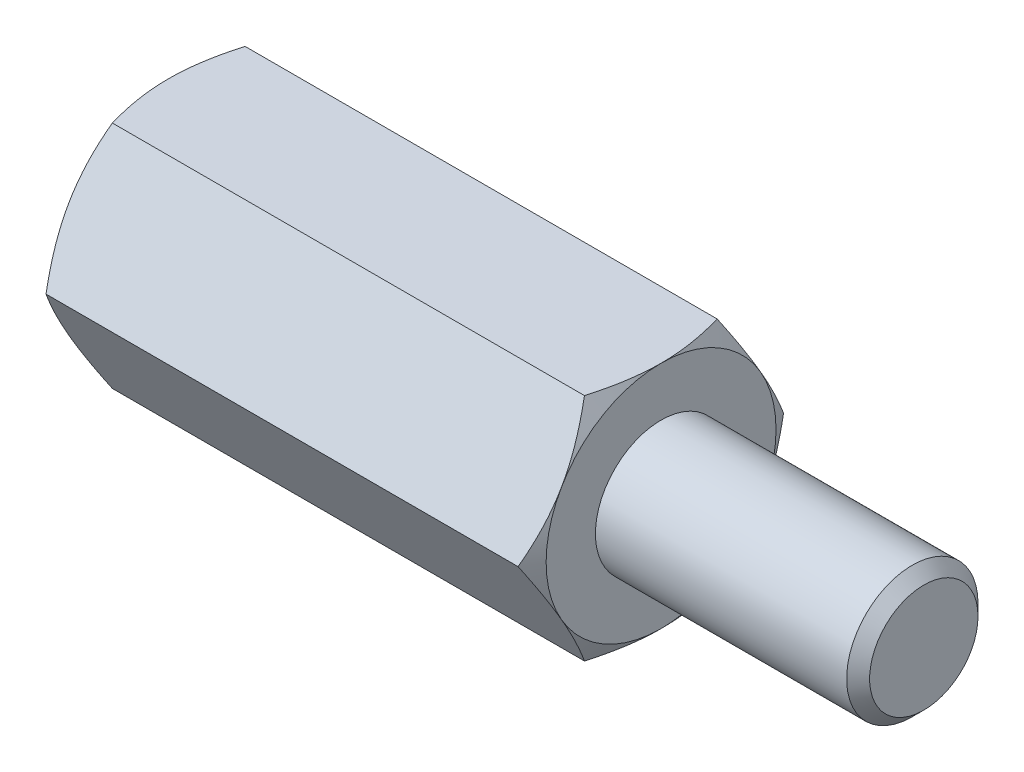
ISO-10303-21;
HEADER;
FILE_DESCRIPTION(('STEP AP214'),'2;1');
FILE_NAME('part.step','',(''),(''),'','','');
FILE_SCHEMA(('AUTOMOTIVE_DESIGN { 1 0 10303 214 1 1 1 1 }'));
ENDSEC;
DATA;
#1=APPLICATION_CONTEXT('core data for automotive mechanical design processes');
#2=APPLICATION_PROTOCOL_DEFINITION('international standard','automotive_design',2000,#1);
#3=PRODUCT_CONTEXT('',#1,'mechanical');
#4=PRODUCT('Part','Part','',(#3));
#5=PRODUCT_RELATED_PRODUCT_CATEGORY('part','',(#4));
#6=PRODUCT_DEFINITION_FORMATION('','',#4);
#7=PRODUCT_DEFINITION_CONTEXT('part definition',#1,'design');
#8=PRODUCT_DEFINITION('design','',#6,#7);
#9=PRODUCT_DEFINITION_SHAPE('','',#8);
#10=(LENGTH_UNIT() NAMED_UNIT(*) SI_UNIT(.MILLI.,.METRE.));
#11=(NAMED_UNIT(*) PLANE_ANGLE_UNIT() SI_UNIT($,.RADIAN.));
#12=(NAMED_UNIT(*) SI_UNIT($,.STERADIAN.) SOLID_ANGLE_UNIT());
#13=UNCERTAINTY_MEASURE_WITH_UNIT(LENGTH_MEASURE(1.E-05),#10,'distance_accuracy_value','');
#14=(GEOMETRIC_REPRESENTATION_CONTEXT(3) GLOBAL_UNCERTAINTY_ASSIGNED_CONTEXT((#13)) GLOBAL_UNIT_ASSIGNED_CONTEXT((#10,
#11,#12)) REPRESENTATION_CONTEXT('',''));
#15=CARTESIAN_POINT('',(0.,0.,0.));
#16=DIRECTION('',(0.,0.,1.));
#17=DIRECTION('',(1.,0.,0.));
#18=AXIS2_PLACEMENT_3D('',#15,#16,#17);
#19=CARTESIAN_POINT('',(7.5,3.5,-2.02072594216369));
#20=DIRECTION('',(1.,0.,0.));
#21=DIRECTION('',(0.,0.,-1.));
#22=AXIS2_PLACEMENT_3D('',#19,#20,#21);
#23=PLANE('',#22);
#24=CARTESIAN_POINT('',(7.5,0.,0.));
#25=DIRECTION('',(1.,0.,0.));
#26=DIRECTION('',(0.,0.,-1.));
#27=AXIS2_PLACEMENT_3D('',#24,#25,#26);
#28=CIRCLE('',#27,3.5);
#29=CARTESIAN_POINT('',(7.5,-1.75,-3.03108891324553));
#30=VERTEX_POINT('',#29);
#31=CARTESIAN_POINT('',(7.5,1.75,-3.03108891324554));
#32=VERTEX_POINT('',#31);
#33=EDGE_CURVE('E288',#30,#32,#28,.T.);
#34=ORIENTED_EDGE('',*,*,#33,.T.);
#35=CARTESIAN_POINT('',(7.5,3.5,0.));
#36=VERTEX_POINT('',#35);
#37=EDGE_CURVE('E53',#32,#36,#28,.T.);
#38=ORIENTED_EDGE('',*,*,#37,.T.);
#39=CARTESIAN_POINT('',(7.5,1.75,3.03108891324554));
#40=VERTEX_POINT('',#39);
#41=EDGE_CURVE('E296',#36,#40,#28,.T.);
#42=ORIENTED_EDGE('',*,*,#41,.T.);
#43=CARTESIAN_POINT('',(7.5,-1.75,3.03108891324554));
#44=VERTEX_POINT('',#43);
#45=EDGE_CURVE('E301',#40,#44,#28,.T.);
#46=ORIENTED_EDGE('',*,*,#45,.T.);
#47=CARTESIAN_POINT('',(7.5,0.,0.));
#48=DIRECTION('',(-1.,0.,0.));
#49=DIRECTION('',(0.,-1.,0.));
#50=AXIS2_PLACEMENT_3D('',#47,#48,#49);
#51=CIRCLE('',#50,3.5);
#52=CARTESIAN_POINT('',(7.5,-3.5,0.));
#53=VERTEX_POINT('',#52);
#54=EDGE_CURVE('E193',#53,#44,#51,.T.);
#55=ORIENTED_EDGE('',*,*,#54,.F.);
#56=EDGE_CURVE('E61',#53,#30,#28,.T.);
#57=ORIENTED_EDGE('',*,*,#56,.T.);
#58=EDGE_LOOP('',(#34,#38,#42,#46,#55,#57));
#59=FACE_BOUND('',#58,.T.);
#60=CARTESIAN_POINT('',(7.5,0.,0.));
#61=DIRECTION('',(1.,0.,0.));
#62=DIRECTION('',(0.,0.,-1.));
#63=AXIS2_PLACEMENT_3D('',#60,#61,#62);
#64=CIRCLE('',#63,2.);
#65=CARTESIAN_POINT('',(7.5,0.,-2.));
#66=VERTEX_POINT('',#65);
#67=EDGE_CURVE('E311',#66,#66,#64,.T.);
#68=ORIENTED_EDGE('',*,*,#67,.F.);
#69=EDGE_LOOP('',(#68));
#70=FACE_BOUND('',#69,.T.);
#71=ADVANCED_FACE('F37',(#59,#70),#23,.T.);
#72=CARTESIAN_POINT('',(7.5,0.,-4.04145188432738));
#73=DIRECTION('',(0.,-0.5,0.866025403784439));
#74=DIRECTION('',(0.,-0.866025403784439,-0.5));
#75=AXIS2_PLACEMENT_3D('',#72,#73,#74);
#76=PLANE('',#75);
#77=CARTESIAN_POINT('',(7.18732593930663,-0.000200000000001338,-4.04156735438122));
#78=CARTESIAN_POINT('',(7.23861421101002,0.153607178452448,-3.9527667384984));
#79=CARTESIAN_POINT('',(7.28525904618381,0.308742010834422,-3.86319960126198));
#80=CARTESIAN_POINT('',(7.36667812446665,0.621698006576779,-3.68251437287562));
#81=CARTESIAN_POINT('',(7.40142356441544,0.779524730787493,-3.59139307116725));
#82=CARTESIAN_POINT('',(7.45550997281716,1.09322221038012,-3.41027974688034));
#83=CARTESIAN_POINT('',(7.47521091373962,1.24904469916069,-3.32031559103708));
#84=CARTESIAN_POINT('',(7.49872986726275,1.56142288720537,-3.13996396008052));
#85=CARTESIAN_POINT('',(7.50256735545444,1.71797745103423,-3.04957714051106));
#86=CARTESIAN_POINT('',(7.49458469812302,2.01050921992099,-2.88068384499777));
#87=CARTESIAN_POINT('',(7.48472456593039,2.1465302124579,-2.80215208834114));
#88=CARTESIAN_POINT('',(7.4534735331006,2.41768602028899,-2.64560020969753));
#89=CARTESIAN_POINT('',(7.4320719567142,2.55281989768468,-2.56758062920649));
#90=CARTESIAN_POINT('',(7.37856959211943,2.82453479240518,-2.41070596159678));
#91=CARTESIAN_POINT('',(7.34624200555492,2.96108141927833,-2.33187072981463));
#92=CARTESIAN_POINT('',(7.27287106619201,3.2321380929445,-2.17537608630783));
#93=CARTESIAN_POINT('',(7.23184495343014,3.36665161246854,-2.09771466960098));
#94=CARTESIAN_POINT('',(7.18732593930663,3.5002,-2.02061047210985));
#95=B_SPLINE_CURVE_WITH_KNOTS('',3,(#77,#78,#79,#80,#81,#82,#83,#84,#85,#86,#87,#88,#89,#90,#91,
#92,#93,#94),.UNSPECIFIED.,.F.,.F.,(4,2,2,2,2,2,2,2,4),(0.,0.554793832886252,1.11092123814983,
1.65328467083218,2.19498204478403,2.6666513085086,3.13875761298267,3.6213361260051,
4.10296698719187),.UNSPECIFIED.);
#96=CARTESIAN_POINT('',(7.18739260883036,0.,-4.04145188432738));
#97=VERTEX_POINT('',#96);
#98=EDGE_CURVE('E352',#97,#32,#95,.T.);
#99=ORIENTED_EDGE('',*,*,#98,.F.);
#100=DIRECTION('',(-1.,0.,0.));
#101=VECTOR('',#100,1.);
#102=CARTESIAN_POINT('',(7.5,0.,-4.04145188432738));
#103=LINE('',#102,#101);
#104=CARTESIAN_POINT('',(-7.18739260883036,0.,-4.04145188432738));
#105=VERTEX_POINT('',#104);
#106=EDGE_CURVE('E264',#97,#105,#103,.T.);
#107=ORIENTED_EDGE('',*,*,#106,.T.);
#108=CARTESIAN_POINT('',(-7.18732593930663,3.5002,-2.02061047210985));
#109=CARTESIAN_POINT('',(-7.23861421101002,3.34639282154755,-2.10941108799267));
#110=CARTESIAN_POINT('',(-7.2852590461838,3.19125798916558,-2.19897822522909));
#111=CARTESIAN_POINT('',(-7.36667812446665,2.87830199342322,-2.37966345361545));
#112=CARTESIAN_POINT('',(-7.40142356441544,2.7204752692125,-2.47078475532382));
#113=CARTESIAN_POINT('',(-7.45550997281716,2.40677778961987,-2.65189807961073));
#114=CARTESIAN_POINT('',(-7.47521091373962,2.25095530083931,-2.74186223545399));
#115=CARTESIAN_POINT('',(-7.49872986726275,1.93857711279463,-2.92221386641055));
#116=CARTESIAN_POINT('',(-7.50256735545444,1.78202254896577,-3.01260068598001));
#117=CARTESIAN_POINT('',(-7.49458469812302,1.48949078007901,-3.1814939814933));
#118=CARTESIAN_POINT('',(-7.48472456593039,1.3534697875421,-3.26002573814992));
#119=CARTESIAN_POINT('',(-7.4534735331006,1.08231397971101,-3.41657761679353));
#120=CARTESIAN_POINT('',(-7.4320719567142,0.947180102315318,-3.49459719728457));
#121=CARTESIAN_POINT('',(-7.37856959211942,0.675465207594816,-3.65147186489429));
#122=CARTESIAN_POINT('',(-7.34624200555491,0.538918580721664,-3.73030709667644));
#123=CARTESIAN_POINT('',(-7.27287106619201,0.267861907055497,-3.88680174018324));
#124=CARTESIAN_POINT('',(-7.23184495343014,0.133348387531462,-3.96446315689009));
#125=CARTESIAN_POINT('',(-7.18732593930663,-0.000200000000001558,-4.04156735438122));
#126=B_SPLINE_CURVE_WITH_KNOTS('',3,(#108,#109,#110,#111,#112,#113,#114,#115,#116,#117,#118,
#119,#120,#121,#122,#123,#124,#125),.UNSPECIFIED.,.F.,.F.,(4,2,2,2,2,2,2,2,4),(0.,
0.554793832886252,1.11092123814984,1.65328467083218,2.19498204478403,2.6666513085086,
3.13875761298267,3.6213361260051,4.10296698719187),.UNSPECIFIED.);
#127=CARTESIAN_POINT('',(-7.5,1.75,-3.03108891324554));
#128=VERTEX_POINT('',#127);
#129=EDGE_CURVE('E342',#128,#105,#126,.T.);
#130=ORIENTED_EDGE('',*,*,#129,.F.);
#131=CARTESIAN_POINT('',(-7.18739260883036,3.5,-2.02072594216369));
#132=VERTEX_POINT('',#131);
#133=EDGE_CURVE('E394',#132,#128,#126,.T.);
#134=ORIENTED_EDGE('',*,*,#133,.F.);
#135=DIRECTION('',(-1.,0.,0.));
#136=VECTOR('',#135,1.);
#137=CARTESIAN_POINT('',(7.5,3.5,-2.02072594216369));
#138=LINE('',#137,#136);
#139=CARTESIAN_POINT('',(7.18739260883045,3.5,-2.02072594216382));
#140=VERTEX_POINT('',#139);
#141=EDGE_CURVE('E279',#140,#132,#138,.T.);
#142=ORIENTED_EDGE('',*,*,#141,.F.);
#143=EDGE_CURVE('E229',#32,#140,#95,.T.);
#144=ORIENTED_EDGE('',*,*,#143,.F.);
#145=EDGE_LOOP('',(#99,#107,#130,#134,#142,#144));
#146=FACE_BOUND('',#145,.T.);
#147=ADVANCED_FACE('F148',(#146),#76,.F.);
#148=CARTESIAN_POINT('',(7.5,3.5,-2.02072594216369));
#149=DIRECTION('',(0.,-1.,0.));
#150=DIRECTION('',(0.,0.,-1.));
#151=AXIS2_PLACEMENT_3D('',#148,#149,#150);
#152=PLANE('',#151);
#153=CARTESIAN_POINT('',(5.74432944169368,3.5,-5.52571367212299));
#154=CARTESIAN_POINT('',(5.8192813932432,3.5,-5.37200190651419));
#155=CARTESIAN_POINT('',(5.89354243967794,3.5,-5.21794762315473));
#156=CARTESIAN_POINT('',(6.04029601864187,3.5,-4.90897223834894));
#157=CARTESIAN_POINT('',(6.11278829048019,3.5,-4.75405101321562));
#158=CARTESIAN_POINT('',(6.25596172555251,3.5,-4.44240758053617));
#159=CARTESIAN_POINT('',(6.32663168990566,3.5,-4.28568021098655));
#160=CARTESIAN_POINT('',(6.46520746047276,3.5,-3.97101270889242));
#161=CARTESIAN_POINT('',(6.53311339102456,3.5,-3.81307263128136));
#162=CARTESIAN_POINT('',(6.66771439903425,3.5,-3.49026114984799));
#163=CARTESIAN_POINT('',(6.73428710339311,3.5,-3.32533845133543));
#164=CARTESIAN_POINT('',(6.86262677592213,3.5,-2.99359992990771));
#165=CARTESIAN_POINT('',(6.92439321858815,3.5,-2.82678390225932));
#166=CARTESIAN_POINT('',(7.04157006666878,3.5,-2.49127529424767));
#167=CARTESIAN_POINT('',(7.09699254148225,3.5,-2.32258697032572));
#168=CARTESIAN_POINT('',(7.19976794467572,3.5,-1.98279215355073));
#169=CARTESIAN_POINT('',(7.24712331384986,3.5,-1.81168640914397));
#170=CARTESIAN_POINT('',(7.33129873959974,3.5,-1.46793354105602));
#171=CARTESIAN_POINT('',(7.36817965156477,3.5,-1.2953015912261));
#172=CARTESIAN_POINT('',(7.42939557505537,3.5,-0.94779164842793));
#173=CARTESIAN_POINT('',(7.45373192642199,3.5,-0.772913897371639));
#174=CARTESIAN_POINT('',(7.4876038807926,3.5,-0.424108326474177));
#175=CARTESIAN_POINT('',(7.49733725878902,3.5,-0.25020019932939));
#176=CARTESIAN_POINT('',(7.50170533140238,3.5,0.097823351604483));
#177=CARTESIAN_POINT('',(7.49633996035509,3.5,0.271938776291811));
#178=CARTESIAN_POINT('',(7.47501181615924,3.5,0.564711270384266));
#179=CARTESIAN_POINT('',(7.46289198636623,3.5,0.683667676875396));
#180=CARTESIAN_POINT('',(7.43230809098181,3.5,0.920767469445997));
#181=CARTESIAN_POINT('',(7.41384324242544,3.5,1.03891075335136));
#182=CARTESIAN_POINT('',(7.34989562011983,3.5,1.39193174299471));
#183=CARTESIAN_POINT('',(7.29586958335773,3.5,1.62528232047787));
#184=CARTESIAN_POINT('',(7.20145152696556,3.5,1.97433825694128));
#185=CARTESIAN_POINT('',(7.16729009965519,3.5,2.09183268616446));
#186=CARTESIAN_POINT('',(7.09523444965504,3.5,2.32568238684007));
#187=CARTESIAN_POINT('',(7.05734019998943,3.5,2.44203765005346));
#188=CARTESIAN_POINT('',(6.97844216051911,3.5,2.67364238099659));
#189=CARTESIAN_POINT('',(6.93743925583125,3.5,2.78889215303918));
#190=CARTESIAN_POINT('',(6.85282457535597,3.5,3.01842460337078));
#191=CARTESIAN_POINT('',(6.80921284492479,3.5,3.13270729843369));
#192=CARTESIAN_POINT('',(6.69582414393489,3.5,3.42150510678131));
#193=CARTESIAN_POINT('',(6.62456360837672,3.5,3.59543696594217));
#194=CARTESIAN_POINT('',(6.47810267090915,3.5,3.94163961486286));
#195=CARTESIAN_POINT('',(6.40290192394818,3.5,4.11391025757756));
#196=CARTESIAN_POINT('',(6.24942525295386,3.5,4.45713072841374));
#197=CARTESIAN_POINT('',(6.17114846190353,3.5,4.62808016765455));
#198=CARTESIAN_POINT('',(6.01218826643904,3.5,4.9688584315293));
#199=CARTESIAN_POINT('',(5.93150479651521,3.5,5.13868722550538));
#200=CARTESIAN_POINT('',(5.68638713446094,3.5,5.64726192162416));
#201=CARTESIAN_POINT('',(5.5190975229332,3.5,5.98463020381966));
#202=CARTESIAN_POINT('',(5.17958549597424,3.5,6.65678495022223));
#203=CARTESIAN_POINT('',(5.0073639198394,3.5,6.99157184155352));
#204=CARTESIAN_POINT('',(4.67608002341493,3.5,7.62749570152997));
#205=CARTESIAN_POINT('',(4.51732992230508,3.5,7.92879562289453));
#206=CARTESIAN_POINT('',(4.19774734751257,3.5,8.53030635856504));
#207=CARTESIAN_POINT('',(4.03691477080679,3.5,8.83051711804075));
#208=CARTESIAN_POINT('',(3.71417926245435,3.5,9.42918006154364));
#209=CARTESIAN_POINT('',(3.5522810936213,3.5,9.72763481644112));
#210=CARTESIAN_POINT('',(3.22727376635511,3.5,10.3238577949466));
#211=CARTESIAN_POINT('',(3.06416469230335,3.5,10.6216260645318));
#212=CARTESIAN_POINT('',(2.90061041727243,3.5,10.9191478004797));
#213=B_SPLINE_CURVE_WITH_KNOTS('',3,(#153,#154,#155,#156,#157,#158,#159,#160,#161,#162,#163,
#164,#165,#166,#167,#168,#169,#170,#171,#172,#173,#174,#175,#176,#177,#178,#179,#180,#181,#182,
#183,#184,#185,#186,#187,#188,#189,#190,#191,#192,#193,#194,#195,#196,#197,#198,#199,#200,#201,
#202,#203,#204,#205,#206,#207,#208,#209,#210,#211,#212),.UNSPECIFIED.,.F.,.F.,(4,2,2,2,2,2,2,2,
2,2,2,2,2,2,2,2,2,2,2,2,2,2,2,2,2,2,2,2,2,4),(0.,0.513041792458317,1.02615874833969,
1.54190801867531,2.05763406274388,2.59113284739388,3.1246898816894,3.65721433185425,
4.18957737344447,4.71878103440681,5.24792816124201,5.76984197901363,6.29175806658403,
6.65030258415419,7.0088913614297,7.72642330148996,8.09346920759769,8.46051776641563,
8.8274622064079,9.19440026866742,9.75822236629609,10.3220939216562,10.8861255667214,
11.4501725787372,12.579801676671,13.7092396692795,14.730918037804,15.7526471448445,
16.7712589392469,17.7898004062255),.UNSPECIFIED.);
#214=EDGE_CURVE('E227',#140,#36,#213,.T.);
#215=ORIENTED_EDGE('',*,*,#214,.F.);
#216=ORIENTED_EDGE('',*,*,#141,.T.);
#217=CARTESIAN_POINT('',(-5.74432944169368,3.5,-5.52571367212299));
#218=CARTESIAN_POINT('',(-5.8192813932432,3.5,-5.37200190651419));
#219=CARTESIAN_POINT('',(-5.89354243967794,3.5,-5.21794762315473));
#220=CARTESIAN_POINT('',(-6.04029601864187,3.5,-4.90897223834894));
#221=CARTESIAN_POINT('',(-6.11278829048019,3.5,-4.75405101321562));
#222=CARTESIAN_POINT('',(-6.25596172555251,3.5,-4.44240758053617));
#223=CARTESIAN_POINT('',(-6.32663168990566,3.5,-4.28568021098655));
#224=CARTESIAN_POINT('',(-6.46520746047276,3.5,-3.97101270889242));
#225=CARTESIAN_POINT('',(-6.53311339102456,3.5,-3.81307263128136));
#226=CARTESIAN_POINT('',(-6.66771439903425,3.5,-3.49026114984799));
#227=CARTESIAN_POINT('',(-6.73428710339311,3.5,-3.32533845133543));
#228=CARTESIAN_POINT('',(-6.86262677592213,3.5,-2.99359992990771));
#229=CARTESIAN_POINT('',(-6.92439321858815,3.5,-2.82678390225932));
#230=CARTESIAN_POINT('',(-7.04157006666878,3.5,-2.49127529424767));
#231=CARTESIAN_POINT('',(-7.09699254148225,3.5,-2.32258697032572));
#232=CARTESIAN_POINT('',(-7.19976794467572,3.5,-1.98279215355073));
#233=CARTESIAN_POINT('',(-7.24712331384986,3.5,-1.81168640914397));
#234=CARTESIAN_POINT('',(-7.33129873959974,3.5,-1.46793354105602));
#235=CARTESIAN_POINT('',(-7.36817965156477,3.5,-1.2953015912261));
#236=CARTESIAN_POINT('',(-7.42939557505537,3.5,-0.94779164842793));
#237=CARTESIAN_POINT('',(-7.45373192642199,3.5,-0.772913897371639));
#238=CARTESIAN_POINT('',(-7.4876038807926,3.5,-0.424108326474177));
#239=CARTESIAN_POINT('',(-7.49733725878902,3.5,-0.25020019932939));
#240=CARTESIAN_POINT('',(-7.50170533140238,3.5,0.0978233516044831));
#241=CARTESIAN_POINT('',(-7.49633996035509,3.5,0.271938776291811));
#242=CARTESIAN_POINT('',(-7.47501181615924,3.5,0.564711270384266));
#243=CARTESIAN_POINT('',(-7.46289198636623,3.5,0.683667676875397));
#244=CARTESIAN_POINT('',(-7.43230809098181,3.5,0.920767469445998));
#245=CARTESIAN_POINT('',(-7.41384324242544,3.5,1.03891075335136));
#246=CARTESIAN_POINT('',(-7.34989562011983,3.5,1.39193174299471));
#247=CARTESIAN_POINT('',(-7.29586958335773,3.5,1.62528232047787));
#248=CARTESIAN_POINT('',(-7.20145152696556,3.5,1.97433825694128));
#249=CARTESIAN_POINT('',(-7.16729009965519,3.5,2.09183268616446));
#250=CARTESIAN_POINT('',(-7.09523444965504,3.5,2.32568238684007));
#251=CARTESIAN_POINT('',(-7.05734019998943,3.5,2.44203765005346));
#252=CARTESIAN_POINT('',(-6.97844216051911,3.5,2.67364238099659));
#253=CARTESIAN_POINT('',(-6.93743925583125,3.5,2.78889215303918));
#254=CARTESIAN_POINT('',(-6.85282457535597,3.5,3.01842460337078));
#255=CARTESIAN_POINT('',(-6.80921284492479,3.5,3.13270729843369));
#256=CARTESIAN_POINT('',(-6.69582414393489,3.5,3.42150510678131));
#257=CARTESIAN_POINT('',(-6.62456360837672,3.5,3.59543696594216));
#258=CARTESIAN_POINT('',(-6.47810267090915,3.5,3.94163961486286));
#259=CARTESIAN_POINT('',(-6.40290192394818,3.5,4.11391025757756));
#260=CARTESIAN_POINT('',(-6.24942525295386,3.5,4.45713072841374));
#261=CARTESIAN_POINT('',(-6.17114846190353,3.5,4.62808016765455));
#262=CARTESIAN_POINT('',(-6.01218826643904,3.5,4.9688584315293));
#263=CARTESIAN_POINT('',(-5.93150479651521,3.5,5.13868722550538));
#264=CARTESIAN_POINT('',(-5.68638713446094,3.5,5.64726192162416));
#265=CARTESIAN_POINT('',(-5.5190975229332,3.5,5.98463020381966));
#266=CARTESIAN_POINT('',(-5.17958549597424,3.5,6.65678495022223));
#267=CARTESIAN_POINT('',(-5.0073639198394,3.5,6.99157184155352));
#268=CARTESIAN_POINT('',(-4.67608002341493,3.5,7.62749570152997));
#269=CARTESIAN_POINT('',(-4.51732992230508,3.5,7.92879562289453));
#270=CARTESIAN_POINT('',(-4.19774734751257,3.5,8.53030635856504));
#271=CARTESIAN_POINT('',(-4.03691477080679,3.5,8.83051711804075));
#272=CARTESIAN_POINT('',(-3.71417926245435,3.5,9.42918006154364));
#273=CARTESIAN_POINT('',(-3.5522810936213,3.5,9.72763481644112));
#274=CARTESIAN_POINT('',(-3.2272737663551,3.5,10.3238577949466));
#275=CARTESIAN_POINT('',(-3.06416469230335,3.5,10.6216260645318));
#276=CARTESIAN_POINT('',(-2.90061041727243,3.5,10.9191478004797));
#277=B_SPLINE_CURVE_WITH_KNOTS('',3,(#217,#218,#219,#220,#221,#222,#223,#224,#225,#226,#227,
#228,#229,#230,#231,#232,#233,#234,#235,#236,#237,#238,#239,#240,#241,#242,#243,#244,#245,#246,
#247,#248,#249,#250,#251,#252,#253,#254,#255,#256,#257,#258,#259,#260,#261,#262,#263,#264,#265,
#266,#267,#268,#269,#270,#271,#272,#273,#274,#275,#276),.UNSPECIFIED.,.F.,.F.,(4,2,2,2,2,2,2,2,
2,2,2,2,2,2,2,2,2,2,2,2,2,2,2,2,2,2,2,2,2,4),(0.,0.513041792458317,1.02615874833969,
1.54190801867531,2.05763406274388,2.59113284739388,3.1246898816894,3.65721433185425,
4.18957737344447,4.71878103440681,5.24792816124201,5.76984197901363,6.29175806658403,
6.65030258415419,7.0088913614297,7.72642330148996,8.09346920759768,8.46051776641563,
8.8274622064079,9.19440026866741,9.75822236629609,10.3220939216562,10.8861255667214,
11.4501725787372,12.579801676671,13.7092396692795,14.730918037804,15.7526471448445,
16.7712589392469,17.7898004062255),.UNSPECIFIED.);
#278=CARTESIAN_POINT('',(-7.5,3.5,0.));
#279=VERTEX_POINT('',#278);
#280=EDGE_CURVE('E241',#279,#132,#277,.F.);
#281=ORIENTED_EDGE('',*,*,#280,.F.);
#282=CARTESIAN_POINT('',(-7.18739260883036,3.5,2.02072594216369));
#283=VERTEX_POINT('',#282);
#284=EDGE_CURVE('E249',#283,#279,#277,.F.);
#285=ORIENTED_EDGE('',*,*,#284,.F.);
#286=DIRECTION('',(-1.,0.,0.));
#287=VECTOR('',#286,1.);
#288=CARTESIAN_POINT('',(7.5,3.5,2.02072594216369));
#289=LINE('',#288,#287);
#290=CARTESIAN_POINT('',(7.18739260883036,3.5,2.02072594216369));
#291=VERTEX_POINT('',#290);
#292=EDGE_CURVE('E276',#291,#283,#289,.T.);
#293=ORIENTED_EDGE('',*,*,#292,.F.);
#294=EDGE_CURVE('E221',#36,#291,#213,.T.);
#295=ORIENTED_EDGE('',*,*,#294,.F.);
#296=EDGE_LOOP('',(#215,#216,#281,#285,#293,#295));
#297=FACE_BOUND('',#296,.T.);
#298=ADVANCED_FACE('F153',(#297),#152,.F.);
#299=CARTESIAN_POINT('',(7.5,3.5,2.02072594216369));
#300=DIRECTION('',(0.,-0.5,-0.866025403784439));
#301=DIRECTION('',(0.,0.866025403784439,-0.5));
#302=AXIS2_PLACEMENT_3D('',#299,#300,#301);
#303=PLANE('',#302);
#304=CARTESIAN_POINT('',(7.18732593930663,3.5002,2.02061047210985));
#305=CARTESIAN_POINT('',(7.23861421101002,3.34639282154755,2.10941108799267));
#306=CARTESIAN_POINT('',(7.28525904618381,3.19125798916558,2.19897822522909));
#307=CARTESIAN_POINT('',(7.36667812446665,2.87830199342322,2.37966345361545));
#308=CARTESIAN_POINT('',(7.40142356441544,2.7204752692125,2.47078475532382));
#309=CARTESIAN_POINT('',(7.45550997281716,2.40677778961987,2.65189807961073));
#310=CARTESIAN_POINT('',(7.47521091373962,2.25095530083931,2.74186223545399));
#311=CARTESIAN_POINT('',(7.49872986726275,1.93857711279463,2.92221386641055));
#312=CARTESIAN_POINT('',(7.50256735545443,1.78202254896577,3.01260068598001));
#313=CARTESIAN_POINT('',(7.49458469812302,1.48949078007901,3.1814939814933));
#314=CARTESIAN_POINT('',(7.48472456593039,1.35346978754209,3.26002573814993));
#315=CARTESIAN_POINT('',(7.4534735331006,1.08231397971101,3.41657761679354));
#316=CARTESIAN_POINT('',(7.4320719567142,0.947180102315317,3.49459719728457));
#317=CARTESIAN_POINT('',(7.37856959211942,0.675465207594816,3.65147186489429));
#318=CARTESIAN_POINT('',(7.34624200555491,0.538918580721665,3.73030709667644));
#319=CARTESIAN_POINT('',(7.27287106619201,0.267861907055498,3.88680174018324));
#320=CARTESIAN_POINT('',(7.23184495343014,0.133348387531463,3.96446315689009));
#321=CARTESIAN_POINT('',(7.18732593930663,-0.000200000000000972,4.04156735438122));
#322=B_SPLINE_CURVE_WITH_KNOTS('',3,(#304,#305,#306,#307,#308,#309,#310,#311,#312,#313,#314,
#315,#316,#317,#318,#319,#320,#321),.UNSPECIFIED.,.F.,.F.,(4,2,2,2,2,2,2,2,4),(0.,
0.554793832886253,1.11092123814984,1.65328467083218,2.19498204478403,2.6666513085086,
3.13875761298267,3.62133612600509,4.10296698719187),.UNSPECIFIED.);
#323=EDGE_CURVE('E228',#291,#40,#322,.T.);
#324=ORIENTED_EDGE('',*,*,#323,.F.);
#325=ORIENTED_EDGE('',*,*,#292,.T.);
#326=CARTESIAN_POINT('',(-7.18732593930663,-0.000200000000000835,4.04156735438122));
#327=CARTESIAN_POINT('',(-7.23861421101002,0.153607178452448,3.9527667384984));
#328=CARTESIAN_POINT('',(-7.28525904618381,0.308742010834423,3.86319960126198));
#329=CARTESIAN_POINT('',(-7.36667812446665,0.62169800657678,3.68251437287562));
#330=CARTESIAN_POINT('',(-7.40142356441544,0.779524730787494,3.59139307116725));
#331=CARTESIAN_POINT('',(-7.45550997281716,1.09322221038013,3.41027974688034));
#332=CARTESIAN_POINT('',(-7.47521091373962,1.24904469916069,3.32031559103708));
#333=CARTESIAN_POINT('',(-7.49872986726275,1.56142288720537,3.13996396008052));
#334=CARTESIAN_POINT('',(-7.50256735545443,1.71797745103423,3.04957714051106));
#335=CARTESIAN_POINT('',(-7.49458469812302,2.01050921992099,2.88068384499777));
#336=CARTESIAN_POINT('',(-7.48472456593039,2.1465302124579,2.80215208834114));
#337=CARTESIAN_POINT('',(-7.4534735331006,2.41768602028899,2.64560020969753));
#338=CARTESIAN_POINT('',(-7.4320719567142,2.55281989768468,2.5675806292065));
#339=CARTESIAN_POINT('',(-7.37856959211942,2.82453479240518,2.41070596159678));
#340=CARTESIAN_POINT('',(-7.34624200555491,2.96108141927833,2.33187072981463));
#341=CARTESIAN_POINT('',(-7.27287106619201,3.2321380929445,2.17537608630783));
#342=CARTESIAN_POINT('',(-7.23184495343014,3.36665161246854,2.09771466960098));
#343=CARTESIAN_POINT('',(-7.18732593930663,3.5002,2.02061047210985));
#344=B_SPLINE_CURVE_WITH_KNOTS('',3,(#326,#327,#328,#329,#330,#331,#332,#333,#334,#335,#336,
#337,#338,#339,#340,#341,#342,#343),.UNSPECIFIED.,.F.,.F.,(4,2,2,2,2,2,2,2,4),(0.,
0.554793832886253,1.11092123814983,1.65328467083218,2.19498204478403,2.6666513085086,
3.13875761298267,3.62133612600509,4.10296698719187),.UNSPECIFIED.);
#345=CARTESIAN_POINT('',(-7.5,1.75,3.03108891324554));
#346=VERTEX_POINT('',#345);
#347=EDGE_CURVE('E255',#346,#283,#344,.T.);
#348=ORIENTED_EDGE('',*,*,#347,.F.);
#349=CARTESIAN_POINT('',(-7.18739260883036,0.,4.04145188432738));
#350=VERTEX_POINT('',#349);
#351=EDGE_CURVE('E262',#350,#346,#344,.T.);
#352=ORIENTED_EDGE('',*,*,#351,.F.);
#353=DIRECTION('',(-1.,0.,0.));
#354=VECTOR('',#353,1.);
#355=CARTESIAN_POINT('',(7.5,0.,4.04145188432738));
#356=LINE('',#355,#354);
#357=CARTESIAN_POINT('',(7.18739260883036,0.,4.04145188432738));
#358=VERTEX_POINT('',#357);
#359=EDGE_CURVE('E273',#358,#350,#356,.T.);
#360=ORIENTED_EDGE('',*,*,#359,.F.);
#361=EDGE_CURVE('E215',#40,#358,#322,.T.);
#362=ORIENTED_EDGE('',*,*,#361,.F.);
#363=EDGE_LOOP('',(#324,#325,#348,#352,#360,#362));
#364=FACE_BOUND('',#363,.T.);
#365=ADVANCED_FACE('F235',(#364),#303,.F.);
#366=CARTESIAN_POINT('',(7.5,0.,4.04145188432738));
#367=DIRECTION('',(0.,0.5,-0.866025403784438));
#368=DIRECTION('',(0.,0.866025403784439,0.5));
#369=AXIS2_PLACEMENT_3D('',#366,#367,#368);
#370=PLANE('',#369);
#371=CARTESIAN_POINT('',(7.18732593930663,0.000199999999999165,4.04156735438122));
#372=CARTESIAN_POINT('',(7.23861421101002,-0.15360717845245,3.9527667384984));
#373=CARTESIAN_POINT('',(7.28525904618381,-0.308742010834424,3.86319960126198));
#374=CARTESIAN_POINT('',(7.36667812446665,-0.621698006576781,3.68251437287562));
#375=CARTESIAN_POINT('',(7.40142356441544,-0.779524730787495,3.59139307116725));
#376=CARTESIAN_POINT('',(7.45550997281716,-1.09322221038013,3.41027974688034));
#377=CARTESIAN_POINT('',(7.47521091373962,-1.24904469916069,3.32031559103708));
#378=CARTESIAN_POINT('',(7.49872986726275,-1.56142288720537,3.13996396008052));
#379=CARTESIAN_POINT('',(7.50256735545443,-1.71797745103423,3.04957714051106));
#380=CARTESIAN_POINT('',(7.49458469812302,-2.01050921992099,2.88068384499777));
#381=CARTESIAN_POINT('',(7.48472456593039,-2.1465302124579,2.80215208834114));
#382=CARTESIAN_POINT('',(7.4534735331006,-2.41768602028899,2.64560020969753));
#383=CARTESIAN_POINT('',(7.4320719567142,-2.55281989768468,2.5675806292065));
#384=CARTESIAN_POINT('',(7.37856959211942,-2.82453479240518,2.41070596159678));
#385=CARTESIAN_POINT('',(7.34624200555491,-2.96108141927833,2.33187072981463));
#386=CARTESIAN_POINT('',(7.27287106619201,-3.2321380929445,2.17537608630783));
#387=CARTESIAN_POINT('',(7.23184495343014,-3.36665161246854,2.09771466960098));
#388=CARTESIAN_POINT('',(7.18732593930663,-3.5002,2.02061047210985));
#389=B_SPLINE_CURVE_WITH_KNOTS('',3,(#371,#372,#373,#374,#375,#376,#377,#378,#379,#380,#381,
#382,#383,#384,#385,#386,#387,#388),.UNSPECIFIED.,.F.,.F.,(4,2,2,2,2,2,2,2,4),(0.,
0.554793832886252,1.11092123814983,1.65328467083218,2.19498204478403,2.6666513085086,
3.13875761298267,3.62133612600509,4.10296698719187),.UNSPECIFIED.);
#390=EDGE_CURVE('E373',#358,#44,#389,.T.);
#391=ORIENTED_EDGE('',*,*,#390,.F.);
#392=ORIENTED_EDGE('',*,*,#359,.T.);
#393=CARTESIAN_POINT('',(-7.18732593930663,-3.5002,2.02061047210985));
#394=CARTESIAN_POINT('',(-7.23861421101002,-3.34639282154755,2.10941108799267));
#395=CARTESIAN_POINT('',(-7.28525904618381,-3.19125798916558,2.19897822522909));
#396=CARTESIAN_POINT('',(-7.36667812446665,-2.87830199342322,2.37966345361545));
#397=CARTESIAN_POINT('',(-7.40142356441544,-2.7204752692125,2.47078475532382));
#398=CARTESIAN_POINT('',(-7.45550997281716,-2.40677778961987,2.65189807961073));
#399=CARTESIAN_POINT('',(-7.47521091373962,-2.25095530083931,2.74186223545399));
#400=CARTESIAN_POINT('',(-7.49872986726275,-1.93857711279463,2.92221386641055));
#401=CARTESIAN_POINT('',(-7.50256735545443,-1.78202254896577,3.01260068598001));
#402=CARTESIAN_POINT('',(-7.49458469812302,-1.48949078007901,3.1814939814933));
#403=CARTESIAN_POINT('',(-7.48472456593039,-1.3534697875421,3.26002573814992));
#404=CARTESIAN_POINT('',(-7.4534735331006,-1.08231397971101,3.41657761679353));
#405=CARTESIAN_POINT('',(-7.4320719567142,-0.947180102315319,3.49459719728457));
#406=CARTESIAN_POINT('',(-7.37856959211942,-0.675465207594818,3.65147186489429));
#407=CARTESIAN_POINT('',(-7.34624200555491,-0.538918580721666,3.73030709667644));
#408=CARTESIAN_POINT('',(-7.27287106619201,-0.2678619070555,3.88680174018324));
#409=CARTESIAN_POINT('',(-7.23184495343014,-0.133348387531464,3.96446315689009));
#410=CARTESIAN_POINT('',(-7.18732593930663,0.000199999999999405,4.04156735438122));
#411=B_SPLINE_CURVE_WITH_KNOTS('',3,(#393,#394,#395,#396,#397,#398,#399,#400,#401,#402,#403,
#404,#405,#406,#407,#408,#409,#410),.UNSPECIFIED.,.F.,.F.,(4,2,2,2,2,2,2,2,4),(0.,
0.554793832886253,1.11092123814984,1.65328467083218,2.19498204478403,2.6666513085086,
3.13875761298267,3.62133612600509,4.10296698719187),.UNSPECIFIED.);
#412=CARTESIAN_POINT('',(-7.5,-1.75,3.03108891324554));
#413=VERTEX_POINT('',#412);
#414=EDGE_CURVE('E263',#413,#350,#411,.T.);
#415=ORIENTED_EDGE('',*,*,#414,.F.);
#416=CARTESIAN_POINT('',(-7.18739260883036,-3.5,2.02072594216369));
#417=VERTEX_POINT('',#416);
#418=EDGE_CURVE('E250',#417,#413,#411,.T.);
#419=ORIENTED_EDGE('',*,*,#418,.F.);
#420=DIRECTION('',(-1.,0.,0.));
#421=VECTOR('',#420,1.);
#422=CARTESIAN_POINT('',(7.5,-3.5,2.02072594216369));
#423=LINE('',#422,#421);
#424=CARTESIAN_POINT('',(7.18739260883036,-3.5,2.02072594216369));
#425=VERTEX_POINT('',#424);
#426=EDGE_CURVE('E270',#425,#417,#423,.T.);
#427=ORIENTED_EDGE('',*,*,#426,.F.);
#428=EDGE_CURVE('E210',#44,#425,#389,.T.);
#429=ORIENTED_EDGE('',*,*,#428,.F.);
#430=EDGE_LOOP('',(#391,#392,#415,#419,#427,#429));
#431=FACE_BOUND('',#430,.T.);
#432=ADVANCED_FACE('F427',(#431),#370,.F.);
#433=CARTESIAN_POINT('',(7.5,-3.5,2.02072594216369));
#434=DIRECTION('',(0.,1.,0.));
#435=DIRECTION('',(0.,0.,1.));
#436=AXIS2_PLACEMENT_3D('',#433,#434,#435);
#437=PLANE('',#436);
#438=CARTESIAN_POINT('',(5.74432944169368,-3.5,-5.525713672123));
#439=CARTESIAN_POINT('',(5.8192813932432,-3.5,-5.37200190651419));
#440=CARTESIAN_POINT('',(5.89354243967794,-3.5,-5.21794762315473));
#441=CARTESIAN_POINT('',(6.04029601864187,-3.5,-4.90897223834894));
#442=CARTESIAN_POINT('',(6.11278829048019,-3.5,-4.75405101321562));
#443=CARTESIAN_POINT('',(6.25596172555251,-3.5,-4.44240758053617));
#444=CARTESIAN_POINT('',(6.32663168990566,-3.5,-4.28568021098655));
#445=CARTESIAN_POINT('',(6.46520746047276,-3.5,-3.97101270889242));
#446=CARTESIAN_POINT('',(6.53311339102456,-3.5,-3.81307263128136));
#447=CARTESIAN_POINT('',(6.66771439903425,-3.5,-3.49026114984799));
#448=CARTESIAN_POINT('',(6.7342871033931,-3.5,-3.32533845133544));
#449=CARTESIAN_POINT('',(6.86262677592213,-3.5,-2.99359992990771));
#450=CARTESIAN_POINT('',(6.92439321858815,-3.5,-2.82678390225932));
#451=CARTESIAN_POINT('',(7.04157006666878,-3.5,-2.49127529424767));
#452=CARTESIAN_POINT('',(7.09699254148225,-3.5,-2.32258697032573));
#453=CARTESIAN_POINT('',(7.19976794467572,-3.5,-1.98279215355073));
#454=CARTESIAN_POINT('',(7.24712331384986,-3.5,-1.81168640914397));
#455=CARTESIAN_POINT('',(7.33129873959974,-3.5,-1.46793354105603));
#456=CARTESIAN_POINT('',(7.36817965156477,-3.5,-1.2953015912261));
#457=CARTESIAN_POINT('',(7.42939557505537,-3.5,-0.947791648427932));
#458=CARTESIAN_POINT('',(7.45373192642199,-3.5,-0.772913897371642));
#459=CARTESIAN_POINT('',(7.4876038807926,-3.5,-0.42410832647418));
#460=CARTESIAN_POINT('',(7.49733725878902,-3.5,-0.250200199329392));
#461=CARTESIAN_POINT('',(7.50170533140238,-3.5,0.0978233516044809));
#462=CARTESIAN_POINT('',(7.49633996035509,-3.5,0.271938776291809));
#463=CARTESIAN_POINT('',(7.47501181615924,-3.5,0.564711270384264));
#464=CARTESIAN_POINT('',(7.46289198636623,-3.5,0.683667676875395));
#465=CARTESIAN_POINT('',(7.43230809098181,-3.5,0.920767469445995));
#466=CARTESIAN_POINT('',(7.41384324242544,-3.5,1.03891075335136));
#467=CARTESIAN_POINT('',(7.34989562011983,-3.5,1.39193174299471));
#468=CARTESIAN_POINT('',(7.29586958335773,-3.5,1.62528232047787));
#469=CARTESIAN_POINT('',(7.20145152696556,-3.5,1.97433825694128));
#470=CARTESIAN_POINT('',(7.16729009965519,-3.5,2.09183268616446));
#471=CARTESIAN_POINT('',(7.09523444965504,-3.5,2.32568238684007));
#472=CARTESIAN_POINT('',(7.05734019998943,-3.5,2.44203765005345));
#473=CARTESIAN_POINT('',(6.97844216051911,-3.5,2.67364238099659));
#474=CARTESIAN_POINT('',(6.93743925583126,-3.5,2.78889215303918));
#475=CARTESIAN_POINT('',(6.85282457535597,-3.5,3.01842460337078));
#476=CARTESIAN_POINT('',(6.8092128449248,-3.5,3.13270729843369));
#477=CARTESIAN_POINT('',(6.69582414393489,-3.5,3.42150510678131));
#478=CARTESIAN_POINT('',(6.62456360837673,-3.5,3.59543696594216));
#479=CARTESIAN_POINT('',(6.47810267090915,-3.5,3.94163961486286));
#480=CARTESIAN_POINT('',(6.40290192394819,-3.5,4.11391025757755));
#481=CARTESIAN_POINT('',(6.24942525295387,-3.5,4.45713072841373));
#482=CARTESIAN_POINT('',(6.17114846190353,-3.5,4.62808016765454));
#483=CARTESIAN_POINT('',(6.01218826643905,-3.5,4.96885843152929));
#484=CARTESIAN_POINT('',(5.93150479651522,-3.5,5.13868722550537));
#485=CARTESIAN_POINT('',(5.68638713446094,-3.5,5.64726192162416));
#486=CARTESIAN_POINT('',(5.51909752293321,-3.5,5.98463020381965));
#487=CARTESIAN_POINT('',(5.17958549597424,-3.5,6.65678495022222));
#488=CARTESIAN_POINT('',(5.0073639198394,-3.5,6.99157184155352));
#489=CARTESIAN_POINT('',(4.67608002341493,-3.5,7.62749570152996));
#490=CARTESIAN_POINT('',(4.51732992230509,-3.5,7.92879562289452));
#491=CARTESIAN_POINT('',(4.19774734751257,-3.5,8.53030635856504));
#492=CARTESIAN_POINT('',(4.03691477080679,-3.5,8.83051711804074));
#493=CARTESIAN_POINT('',(3.71417926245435,-3.5,9.42918006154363));
#494=CARTESIAN_POINT('',(3.5522810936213,-3.5,9.72763481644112));
#495=CARTESIAN_POINT('',(3.22727376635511,-3.5,10.3238577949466));
#496=CARTESIAN_POINT('',(3.06416469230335,-3.5,10.6216260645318));
#497=CARTESIAN_POINT('',(2.90061041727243,-3.5,10.9191478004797));
#498=B_SPLINE_CURVE_WITH_KNOTS('',3,(#438,#439,#440,#441,#442,#443,#444,#445,#446,#447,#448,
#449,#450,#451,#452,#453,#454,#455,#456,#457,#458,#459,#460,#461,#462,#463,#464,#465,#466,#467,
#468,#469,#470,#471,#472,#473,#474,#475,#476,#477,#478,#479,#480,#481,#482,#483,#484,#485,#486,
#487,#488,#489,#490,#491,#492,#493,#494,#495,#496,#497),.UNSPECIFIED.,.F.,.F.,(4,2,2,2,2,2,2,2,
2,2,2,2,2,2,2,2,2,2,2,2,2,2,2,2,2,2,2,2,2,4),(0.,0.513041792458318,1.02615874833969,
1.5419080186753,2.05763406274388,2.59113284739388,3.1246898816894,3.65721433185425,
4.18957737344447,4.71878103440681,5.247928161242,5.76984197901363,6.29175806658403,
6.65030258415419,7.0088913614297,7.72642330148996,8.09346920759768,8.46051776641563,
8.8274622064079,9.19440026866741,9.75822236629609,10.3220939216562,10.8861255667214,
11.4501725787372,12.579801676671,13.7092396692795,14.730918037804,15.7526471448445,
16.7712589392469,17.7898004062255),.UNSPECIFIED.);
#499=EDGE_CURVE('E379',#425,#53,#498,.F.);
#500=ORIENTED_EDGE('',*,*,#499,.F.);
#501=ORIENTED_EDGE('',*,*,#426,.T.);
#502=CARTESIAN_POINT('',(-5.74432944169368,-3.5,-5.52571367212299));
#503=CARTESIAN_POINT('',(-5.8192813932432,-3.5,-5.37200190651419));
#504=CARTESIAN_POINT('',(-5.89354243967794,-3.5,-5.21794762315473));
#505=CARTESIAN_POINT('',(-6.04029601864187,-3.5,-4.90897223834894));
#506=CARTESIAN_POINT('',(-6.11278829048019,-3.5,-4.75405101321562));
#507=CARTESIAN_POINT('',(-6.25596172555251,-3.5,-4.44240758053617));
#508=CARTESIAN_POINT('',(-6.32663168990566,-3.5,-4.28568021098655));
#509=CARTESIAN_POINT('',(-6.46520746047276,-3.5,-3.97101270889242));
#510=CARTESIAN_POINT('',(-6.53311339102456,-3.5,-3.81307263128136));
#511=CARTESIAN_POINT('',(-6.66771439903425,-3.5,-3.49026114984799));
#512=CARTESIAN_POINT('',(-6.7342871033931,-3.5,-3.32533845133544));
#513=CARTESIAN_POINT('',(-6.86262677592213,-3.5,-2.99359992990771));
#514=CARTESIAN_POINT('',(-6.92439321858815,-3.5,-2.82678390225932));
#515=CARTESIAN_POINT('',(-7.04157006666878,-3.5,-2.49127529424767));
#516=CARTESIAN_POINT('',(-7.09699254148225,-3.5,-2.32258697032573));
#517=CARTESIAN_POINT('',(-7.19976794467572,-3.5,-1.98279215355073));
#518=CARTESIAN_POINT('',(-7.24712331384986,-3.5,-1.81168640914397));
#519=CARTESIAN_POINT('',(-7.33129873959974,-3.5,-1.46793354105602));
#520=CARTESIAN_POINT('',(-7.36817965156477,-3.5,-1.2953015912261));
#521=CARTESIAN_POINT('',(-7.42939557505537,-3.5,-0.947791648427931));
#522=CARTESIAN_POINT('',(-7.45373192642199,-3.5,-0.77291389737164));
#523=CARTESIAN_POINT('',(-7.4876038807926,-3.5,-0.424108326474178));
#524=CARTESIAN_POINT('',(-7.49733725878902,-3.5,-0.250200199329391));
#525=CARTESIAN_POINT('',(-7.50170533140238,-3.5,0.0978233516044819));
#526=CARTESIAN_POINT('',(-7.49633996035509,-3.5,0.27193877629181));
#527=CARTESIAN_POINT('',(-7.47501181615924,-3.5,0.564711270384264));
#528=CARTESIAN_POINT('',(-7.46289198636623,-3.5,0.683667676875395));
#529=CARTESIAN_POINT('',(-7.43230809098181,-3.5,0.920767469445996));
#530=CARTESIAN_POINT('',(-7.41384324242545,-3.5,1.03891075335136));
#531=CARTESIAN_POINT('',(-7.34989562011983,-3.5,1.39193174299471));
#532=CARTESIAN_POINT('',(-7.29586958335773,-3.5,1.62528232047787));
#533=CARTESIAN_POINT('',(-7.20145152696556,-3.5,1.97433825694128));
#534=CARTESIAN_POINT('',(-7.16729009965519,-3.5,2.09183268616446));
#535=CARTESIAN_POINT('',(-7.09523444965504,-3.5,2.32568238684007));
#536=CARTESIAN_POINT('',(-7.05734019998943,-3.5,2.44203765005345));
#537=CARTESIAN_POINT('',(-6.97844216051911,-3.5,2.67364238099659));
#538=CARTESIAN_POINT('',(-6.93743925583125,-3.5,2.78889215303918));
#539=CARTESIAN_POINT('',(-6.85282457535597,-3.5,3.01842460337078));
#540=CARTESIAN_POINT('',(-6.8092128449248,-3.5,3.13270729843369));
#541=CARTESIAN_POINT('',(-6.69582414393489,-3.5,3.42150510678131));
#542=CARTESIAN_POINT('',(-6.62456360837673,-3.5,3.59543696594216));
#543=CARTESIAN_POINT('',(-6.47810267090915,-3.5,3.94163961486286));
#544=CARTESIAN_POINT('',(-6.40290192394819,-3.5,4.11391025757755));
#545=CARTESIAN_POINT('',(-6.24942525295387,-3.5,4.45713072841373));
#546=CARTESIAN_POINT('',(-6.17114846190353,-3.5,4.62808016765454));
#547=CARTESIAN_POINT('',(-6.01218826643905,-3.5,4.96885843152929));
#548=CARTESIAN_POINT('',(-5.93150479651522,-3.5,5.13868722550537));
#549=CARTESIAN_POINT('',(-5.68638713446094,-3.5,5.64726192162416));
#550=CARTESIAN_POINT('',(-5.51909752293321,-3.5,5.98463020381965));
#551=CARTESIAN_POINT('',(-5.17958549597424,-3.5,6.65678495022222));
#552=CARTESIAN_POINT('',(-5.0073639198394,-3.5,6.99157184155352));
#553=CARTESIAN_POINT('',(-4.67608002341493,-3.5,7.62749570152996));
#554=CARTESIAN_POINT('',(-4.51732992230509,-3.5,7.92879562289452));
#555=CARTESIAN_POINT('',(-4.19774734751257,-3.5,8.53030635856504));
#556=CARTESIAN_POINT('',(-4.03691477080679,-3.5,8.83051711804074));
#557=CARTESIAN_POINT('',(-3.71417926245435,-3.5,9.42918006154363));
#558=CARTESIAN_POINT('',(-3.5522810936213,-3.5,9.72763481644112));
#559=CARTESIAN_POINT('',(-3.22727376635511,-3.5,10.3238577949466));
#560=CARTESIAN_POINT('',(-3.06416469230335,-3.5,10.6216260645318));
#561=CARTESIAN_POINT('',(-2.90061041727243,-3.5,10.9191478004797));
#562=B_SPLINE_CURVE_WITH_KNOTS('',3,(#502,#503,#504,#505,#506,#507,#508,#509,#510,#511,#512,
#513,#514,#515,#516,#517,#518,#519,#520,#521,#522,#523,#524,#525,#526,#527,#528,#529,#530,#531,
#532,#533,#534,#535,#536,#537,#538,#539,#540,#541,#542,#543,#544,#545,#546,#547,#548,#549,#550,
#551,#552,#553,#554,#555,#556,#557,#558,#559,#560,#561),.UNSPECIFIED.,.F.,.F.,(4,2,2,2,2,2,2,2,
2,2,2,2,2,2,2,2,2,2,2,2,2,2,2,2,2,2,2,2,2,4),(0.,0.513041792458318,1.02615874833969,
1.54190801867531,2.05763406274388,2.59113284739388,3.1246898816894,3.65721433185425,
4.18957737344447,4.71878103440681,5.247928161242,5.76984197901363,6.29175806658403,
6.65030258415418,7.0088913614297,7.72642330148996,8.09346920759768,8.46051776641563,
8.8274622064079,9.19440026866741,9.75822236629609,10.3220939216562,10.8861255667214,
11.4501725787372,12.579801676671,13.7092396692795,14.730918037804,15.7526471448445,
16.7712589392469,17.7898004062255),.UNSPECIFIED.);
#563=CARTESIAN_POINT('',(-7.5,-3.5,0.));
#564=VERTEX_POINT('',#563);
#565=EDGE_CURVE('E343',#564,#417,#562,.T.);
#566=ORIENTED_EDGE('',*,*,#565,.F.);
#567=CARTESIAN_POINT('',(-7.18739260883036,-3.5,-2.02072594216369));
#568=VERTEX_POINT('',#567);
#569=EDGE_CURVE('E336',#568,#564,#562,.T.);
#570=ORIENTED_EDGE('',*,*,#569,.F.);
#571=DIRECTION('',(-1.,0.,0.));
#572=VECTOR('',#571,1.);
#573=CARTESIAN_POINT('',(7.5,-3.5,-2.02072594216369));
#574=LINE('',#573,#572);
#575=CARTESIAN_POINT('',(7.18739260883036,-3.5,-2.02072594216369));
#576=VERTEX_POINT('',#575);
#577=EDGE_CURVE('E267',#576,#568,#574,.T.);
#578=ORIENTED_EDGE('',*,*,#577,.F.);
#579=EDGE_CURVE('E195',#53,#576,#498,.F.);
#580=ORIENTED_EDGE('',*,*,#579,.F.);
#581=EDGE_LOOP('',(#500,#501,#566,#570,#578,#580));
#582=FACE_BOUND('',#581,.T.);
#583=ADVANCED_FACE('F172',(#582),#437,.F.);
#584=CARTESIAN_POINT('',(7.5,-3.5,-2.02072594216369));
#585=DIRECTION('',(0.,0.5,0.866025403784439));
#586=DIRECTION('',(0.,-0.866025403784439,0.5));
#587=AXIS2_PLACEMENT_3D('',#584,#585,#586);
#588=PLANE('',#587);
#589=CARTESIAN_POINT('',(7.18732593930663,-3.5002,-2.02061047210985));
#590=CARTESIAN_POINT('',(7.23861421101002,-3.34639282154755,-2.10941108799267));
#591=CARTESIAN_POINT('',(7.28525904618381,-3.19125798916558,-2.19897822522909));
#592=CARTESIAN_POINT('',(7.36667812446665,-2.87830199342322,-2.37966345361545));
#593=CARTESIAN_POINT('',(7.40142356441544,-2.72047526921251,-2.47078475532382));
#594=CARTESIAN_POINT('',(7.45550997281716,-2.40677778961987,-2.65189807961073));
#595=CARTESIAN_POINT('',(7.47521091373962,-2.25095530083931,-2.74186223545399));
#596=CARTESIAN_POINT('',(7.49872986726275,-1.93857711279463,-2.92221386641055));
#597=CARTESIAN_POINT('',(7.50256735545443,-1.78202254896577,-3.01260068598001));
#598=CARTESIAN_POINT('',(7.49458469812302,-1.48949078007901,-3.1814939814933));
#599=CARTESIAN_POINT('',(7.48472456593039,-1.3534697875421,-3.26002573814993));
#600=CARTESIAN_POINT('',(7.4534735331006,-1.08231397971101,-3.41657761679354));
#601=CARTESIAN_POINT('',(7.4320719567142,-0.94718010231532,-3.49459719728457));
#602=CARTESIAN_POINT('',(7.37856959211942,-0.675465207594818,-3.65147186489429));
#603=CARTESIAN_POINT('',(7.34624200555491,-0.538918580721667,-3.73030709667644));
#604=CARTESIAN_POINT('',(7.27287106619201,-0.2678619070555,-3.88680174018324));
#605=CARTESIAN_POINT('',(7.23184495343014,-0.133348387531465,-3.96446315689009));
#606=CARTESIAN_POINT('',(7.18732593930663,0.000199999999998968,-4.04156735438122));
#607=B_SPLINE_CURVE_WITH_KNOTS('',3,(#589,#590,#591,#592,#593,#594,#595,#596,#597,#598,#599,
#600,#601,#602,#603,#604,#605,#606),.UNSPECIFIED.,.F.,.F.,(4,2,2,2,2,2,2,2,4),(0.,
0.554793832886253,1.11092123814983,1.65328467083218,2.19498204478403,2.6666513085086,
3.13875761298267,3.62133612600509,4.10296698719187),.UNSPECIFIED.);
#608=EDGE_CURVE('E192',#576,#30,#607,.T.);
#609=ORIENTED_EDGE('',*,*,#608,.F.);
#610=ORIENTED_EDGE('',*,*,#577,.T.);
#611=CARTESIAN_POINT('',(-7.18732593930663,0.000199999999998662,-4.04156735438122));
#612=CARTESIAN_POINT('',(-7.23861421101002,-0.153607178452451,-3.9527667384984));
#613=CARTESIAN_POINT('',(-7.28525904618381,-0.308742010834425,-3.86319960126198));
#614=CARTESIAN_POINT('',(-7.36667812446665,-0.621698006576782,-3.68251437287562));
#615=CARTESIAN_POINT('',(-7.40142356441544,-0.779524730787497,-3.59139307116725));
#616=CARTESIAN_POINT('',(-7.45550997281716,-1.09322221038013,-3.41027974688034));
#617=CARTESIAN_POINT('',(-7.47521091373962,-1.24904469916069,-3.32031559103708));
#618=CARTESIAN_POINT('',(-7.49872986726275,-1.56142288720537,-3.13996396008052));
#619=CARTESIAN_POINT('',(-7.50256735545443,-1.71797745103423,-3.04957714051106));
#620=CARTESIAN_POINT('',(-7.49458469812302,-2.01050921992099,-2.88068384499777));
#621=CARTESIAN_POINT('',(-7.48472456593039,-2.14653021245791,-2.80215208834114));
#622=CARTESIAN_POINT('',(-7.4534735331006,-2.41768602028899,-2.64560020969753));
#623=CARTESIAN_POINT('',(-7.4320719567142,-2.55281989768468,-2.5675806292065));
#624=CARTESIAN_POINT('',(-7.37856959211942,-2.82453479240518,-2.41070596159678));
#625=CARTESIAN_POINT('',(-7.34624200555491,-2.96108141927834,-2.33187072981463));
#626=CARTESIAN_POINT('',(-7.27287106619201,-3.2321380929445,-2.17537608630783));
#627=CARTESIAN_POINT('',(-7.23184495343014,-3.36665161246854,-2.09771466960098));
#628=CARTESIAN_POINT('',(-7.18732593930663,-3.5002,-2.02061047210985));
#629=B_SPLINE_CURVE_WITH_KNOTS('',3,(#611,#612,#613,#614,#615,#616,#617,#618,#619,#620,#621,
#622,#623,#624,#625,#626,#627,#628),.UNSPECIFIED.,.F.,.F.,(4,2,2,2,2,2,2,2,4),(0.,
0.554793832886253,1.11092123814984,1.65328467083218,2.19498204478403,2.6666513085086,
3.13875761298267,3.62133612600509,4.10296698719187),.UNSPECIFIED.);
#630=CARTESIAN_POINT('',(-7.5,-1.75,-3.03108891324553));
#631=VERTEX_POINT('',#630);
#632=EDGE_CURVE('E178',#631,#568,#629,.T.);
#633=ORIENTED_EDGE('',*,*,#632,.F.);
#634=EDGE_CURVE('E334',#105,#631,#629,.T.);
#635=ORIENTED_EDGE('',*,*,#634,.F.);
#636=ORIENTED_EDGE('',*,*,#106,.F.);
#637=EDGE_CURVE('E185',#30,#97,#607,.T.);
#638=ORIENTED_EDGE('',*,*,#637,.F.);
#639=EDGE_LOOP('',(#609,#610,#633,#635,#636,#638));
#640=FACE_BOUND('',#639,.T.);
#641=ADVANCED_FACE('F167',(#640),#588,.F.);
#642=CARTESIAN_POINT('',(-7.5,0.,0.));
#643=DIRECTION('',(1.,0.,0.));
#644=DIRECTION('',(0.,1.,0.));
#645=AXIS2_PLACEMENT_3D('',#642,#643,#644);
#646=CONICAL_SURFACE('',#645,3.5,1.0471975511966);
#647=ORIENTED_EDGE('',*,*,#129,.T.);
#648=ORIENTED_EDGE('',*,*,#634,.T.);
#649=CARTESIAN_POINT('',(-7.5,0.,0.));
#650=DIRECTION('',(1.,0.,0.));
#651=DIRECTION('',(0.,0.,-1.));
#652=AXIS2_PLACEMENT_3D('',#649,#650,#651);
#653=CIRCLE('',#652,3.5);
#654=EDGE_CURVE('E282',#631,#128,#653,.T.);
#655=ORIENTED_EDGE('',*,*,#654,.T.);
#656=EDGE_LOOP('',(#647,#648,#655));
#657=FACE_BOUND('',#656,.T.);
#658=ADVANCED_FACE('F171',(#657),#646,.T.);
#659=ORIENTED_EDGE('',*,*,#569,.T.);
#660=EDGE_CURVE('E286',#564,#631,#653,.T.);
#661=ORIENTED_EDGE('',*,*,#660,.T.);
#662=ORIENTED_EDGE('',*,*,#632,.T.);
#663=EDGE_LOOP('',(#659,#661,#662));
#664=FACE_BOUND('',#663,.T.);
#665=ADVANCED_FACE('F424',(#664),#646,.T.);
#666=ORIENTED_EDGE('',*,*,#418,.T.);
#667=CARTESIAN_POINT('',(-7.5,0.,0.));
#668=DIRECTION('',(-1.,0.,0.));
#669=DIRECTION('',(0.,-1.,0.));
#670=AXIS2_PLACEMENT_3D('',#667,#668,#669);
#671=CIRCLE('',#670,3.5);
#672=EDGE_CURVE('E346',#564,#413,#671,.T.);
#673=ORIENTED_EDGE('',*,*,#672,.F.);
#674=ORIENTED_EDGE('',*,*,#565,.T.);
#675=EDGE_LOOP('',(#666,#673,#674));
#676=FACE_BOUND('',#675,.T.);
#677=ADVANCED_FACE('F425',(#676),#646,.T.);
#678=ORIENTED_EDGE('',*,*,#351,.T.);
#679=EDGE_CURVE('E333',#346,#413,#653,.T.);
#680=ORIENTED_EDGE('',*,*,#679,.T.);
#681=ORIENTED_EDGE('',*,*,#414,.T.);
#682=EDGE_LOOP('',(#678,#680,#681));
#683=FACE_BOUND('',#682,.T.);
#684=ADVANCED_FACE('F158',(#683),#646,.T.);
#685=ORIENTED_EDGE('',*,*,#347,.T.);
#686=ORIENTED_EDGE('',*,*,#284,.T.);
#687=EDGE_CURVE('E330',#279,#346,#653,.T.);
#688=ORIENTED_EDGE('',*,*,#687,.T.);
#689=EDGE_LOOP('',(#685,#686,#688));
#690=FACE_BOUND('',#689,.T.);
#691=ADVANCED_FACE('F404',(#690),#646,.T.);
#692=ORIENTED_EDGE('',*,*,#280,.T.);
#693=ORIENTED_EDGE('',*,*,#133,.T.);
#694=EDGE_CURVE('E287',#128,#279,#653,.T.);
#695=ORIENTED_EDGE('',*,*,#694,.T.);
#696=EDGE_LOOP('',(#692,#693,#695));
#697=FACE_BOUND('',#696,.T.);
#698=ADVANCED_FACE('F165',(#697),#646,.T.);
#699=CARTESIAN_POINT('',(-7.5,3.5,-2.02072594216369));
#700=DIRECTION('',(1.,0.,0.));
#701=DIRECTION('',(0.,0.,-1.));
#702=AXIS2_PLACEMENT_3D('',#699,#700,#701);
#703=PLANE('',#702);
#704=CARTESIAN_POINT('',(-7.5,0.,0.));
#705=DIRECTION('',(-1.,0.,0.));
#706=DIRECTION('',(0.,0.,1.));
#707=AXIS2_PLACEMENT_3D('',#704,#705,#706);
#708=CIRCLE('',#707,1.65);
#709=CARTESIAN_POINT('',(-7.5,0.,1.65));
#710=VERTEX_POINT('',#709);
#711=EDGE_CURVE('E314',#710,#710,#708,.T.);
#712=ORIENTED_EDGE('',*,*,#711,.F.);
#713=EDGE_LOOP('',(#712));
#714=FACE_BOUND('',#713,.T.);
#715=ORIENTED_EDGE('',*,*,#694,.F.);
#716=ORIENTED_EDGE('',*,*,#654,.F.);
#717=ORIENTED_EDGE('',*,*,#660,.F.);
#718=ORIENTED_EDGE('',*,*,#672,.T.);
#719=ORIENTED_EDGE('',*,*,#679,.F.);
#720=ORIENTED_EDGE('',*,*,#687,.F.);
#721=EDGE_LOOP('',(#715,#716,#717,#718,#719,#720));
#722=FACE_BOUND('',#721,.T.);
#723=ADVANCED_FACE('F161',(#714,#722),#703,.F.);
#724=CARTESIAN_POINT('',(7.5,0.,0.));
#725=DIRECTION('',(-1.,0.,0.));
#726=DIRECTION('',(0.,1.,0.));
#727=AXIS2_PLACEMENT_3D('',#724,#725,#726);
#728=CONICAL_SURFACE('',#727,3.5,1.0471975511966);
#729=ORIENTED_EDGE('',*,*,#98,.T.);
#730=ORIENTED_EDGE('',*,*,#33,.F.);
#731=ORIENTED_EDGE('',*,*,#637,.T.);
#732=EDGE_LOOP('',(#729,#730,#731));
#733=FACE_BOUND('',#732,.T.);
#734=ADVANCED_FACE('F164',(#733),#728,.T.);
#735=ORIENTED_EDGE('',*,*,#579,.T.);
#736=ORIENTED_EDGE('',*,*,#608,.T.);
#737=ORIENTED_EDGE('',*,*,#56,.F.);
#738=EDGE_LOOP('',(#735,#736,#737));
#739=FACE_BOUND('',#738,.T.);
#740=ADVANCED_FACE('F202',(#739),#728,.T.);
#741=ORIENTED_EDGE('',*,*,#428,.T.);
#742=ORIENTED_EDGE('',*,*,#499,.T.);
#743=ORIENTED_EDGE('',*,*,#54,.T.);
#744=EDGE_LOOP('',(#741,#742,#743));
#745=FACE_BOUND('',#744,.T.);
#746=ADVANCED_FACE('F505',(#745),#728,.T.);
#747=ORIENTED_EDGE('',*,*,#361,.T.);
#748=ORIENTED_EDGE('',*,*,#390,.T.);
#749=ORIENTED_EDGE('',*,*,#45,.F.);
#750=EDGE_LOOP('',(#747,#748,#749));
#751=FACE_BOUND('',#750,.T.);
#752=ADVANCED_FACE('F371',(#751),#728,.T.);
#753=ORIENTED_EDGE('',*,*,#294,.T.);
#754=ORIENTED_EDGE('',*,*,#323,.T.);
#755=ORIENTED_EDGE('',*,*,#41,.F.);
#756=EDGE_LOOP('',(#753,#754,#755));
#757=FACE_BOUND('',#756,.T.);
#758=ADVANCED_FACE('F365',(#757),#728,.T.);
#759=ORIENTED_EDGE('',*,*,#143,.T.);
#760=ORIENTED_EDGE('',*,*,#214,.T.);
#761=ORIENTED_EDGE('',*,*,#37,.F.);
#762=EDGE_LOOP('',(#759,#760,#761));
#763=FACE_BOUND('',#762,.T.);
#764=ADVANCED_FACE('F143',(#763),#728,.T.);
#765=CARTESIAN_POINT('',(0.5,0.,0.));
#766=DIRECTION('',(-1.,0.,0.));
#767=DIRECTION('',(0.,0.,1.));
#768=AXIS2_PLACEMENT_3D('',#765,#766,#767);
#769=CYLINDRICAL_SURFACE('',#768,1.65);
#770=CARTESIAN_POINT('',(0.500000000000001,0.,0.));
#771=DIRECTION('',(1.,0.,0.));
#772=DIRECTION('',(0.,0.,-1.));
#773=AXIS2_PLACEMENT_3D('',#770,#771,#772);
#774=CIRCLE('',#773,1.65);
#775=CARTESIAN_POINT('',(0.500000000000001,0.,-1.65));
#776=VERTEX_POINT('',#775);
#777=EDGE_CURVE('E318',#776,#776,#774,.T.);
#778=ORIENTED_EDGE('',*,*,#777,.T.);
#779=EDGE_LOOP('',(#778));
#780=FACE_BOUND('',#779,.T.);
#781=ORIENTED_EDGE('',*,*,#711,.T.);
#782=EDGE_LOOP('',(#781));
#783=FACE_BOUND('',#782,.T.);
#784=ADVANCED_FACE('F133',(#780,#783),#769,.F.);
#785=CARTESIAN_POINT('',(1.45262794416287,0.,0.));
#786=DIRECTION('',(-1.,0.,0.));
#787=DIRECTION('',(0.,0.,1.));
#788=AXIS2_PLACEMENT_3D('',#785,#786,#787);
#789=CONICAL_SURFACE('',#788,0.,1.0471975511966);
#790=ORIENTED_EDGE('',*,*,#777,.F.);
#791=EDGE_LOOP('',(#790));
#792=FACE_BOUND('',#791,.T.);
#793=CARTESIAN_POINT('',(1.45262794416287,0.,0.));
#794=VERTEX_POINT('',#793);
#795=VERTEX_LOOP('',#794);
#796=FACE_BOUND('',#795,.T.);
#797=ADVANCED_FACE('F130',(#792,#796),#789,.F.);
#798=CARTESIAN_POINT('',(15.5,0.,0.));
#799=DIRECTION('',(-1.,0.,0.));
#800=DIRECTION('',(0.,0.,1.));
#801=AXIS2_PLACEMENT_3D('',#798,#799,#800);
#802=CYLINDRICAL_SURFACE('',#801,2.);
#803=CARTESIAN_POINT('',(15.15,0.,0.));
#804=DIRECTION('',(1.,0.,0.));
#805=DIRECTION('',(0.,0.,-1.));
#806=AXIS2_PLACEMENT_3D('',#803,#804,#805);
#807=CIRCLE('',#806,2.);
#808=CARTESIAN_POINT('',(15.15,0.,-2.));
#809=VERTEX_POINT('',#808);
#810=EDGE_CURVE('E11',#809,#809,#807,.F.);
#811=ORIENTED_EDGE('',*,*,#810,.T.);
#812=EDGE_LOOP('',(#811));
#813=FACE_BOUND('',#812,.T.);
#814=ORIENTED_EDGE('',*,*,#67,.T.);
#815=EDGE_LOOP('',(#814));
#816=FACE_BOUND('',#815,.T.);
#817=ADVANCED_FACE('F132',(#813,#816),#802,.T.);
#818=CARTESIAN_POINT('',(15.5,0.,0.));
#819=DIRECTION('',(1.,0.,0.));
#820=DIRECTION('',(0.,0.,-1.));
#821=AXIS2_PLACEMENT_3D('',#818,#819,#820);
#822=PLANE('',#821);
#823=CARTESIAN_POINT('',(15.5,0.,0.));
#824=DIRECTION('',(1.,0.,0.));
#825=DIRECTION('',(0.,0.,-1.));
#826=AXIS2_PLACEMENT_3D('',#823,#824,#825);
#827=CIRCLE('',#826,1.65);
#828=CARTESIAN_POINT('',(15.5,0.,-1.65));
#829=VERTEX_POINT('',#828);
#830=EDGE_CURVE('E46',#829,#829,#827,.T.);
#831=ORIENTED_EDGE('',*,*,#830,.T.);
#832=EDGE_LOOP('',(#831));
#833=FACE_BOUND('',#832,.T.);
#834=ADVANCED_FACE('F140',(#833),#822,.T.);
#835=CARTESIAN_POINT('',(15.5,0.,0.));
#836=DIRECTION('',(-1.,0.,0.));
#837=DIRECTION('',(0.,0.,1.));
#838=AXIS2_PLACEMENT_3D('',#835,#836,#837);
#839=CONICAL_SURFACE('',#838,1.65,0.785398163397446);
#840=ORIENTED_EDGE('',*,*,#810,.F.);
#841=EDGE_LOOP('',(#840));
#842=FACE_BOUND('',#841,.T.);
#843=ORIENTED_EDGE('',*,*,#830,.F.);
#844=EDGE_LOOP('',(#843));
#845=FACE_BOUND('',#844,.T.);
#846=ADVANCED_FACE('F39',(#842,#845),#839,.T.);
#847=CLOSED_SHELL('',(#71,#147,#298,#365,#432,#583,#641,#658,#665,#677,#684,#691,#698,#723,#734,
#740,#746,#752,#758,#764,#784,#797,#817,#834,#846));
#848=MANIFOLD_SOLID_BREP('B2',#847);
#849=ADVANCED_BREP_SHAPE_REPRESENTATION('',(#18,#848),#14);
#850=SHAPE_DEFINITION_REPRESENTATION(#9,#849);
ENDSEC;
END-ISO-10303-21;
